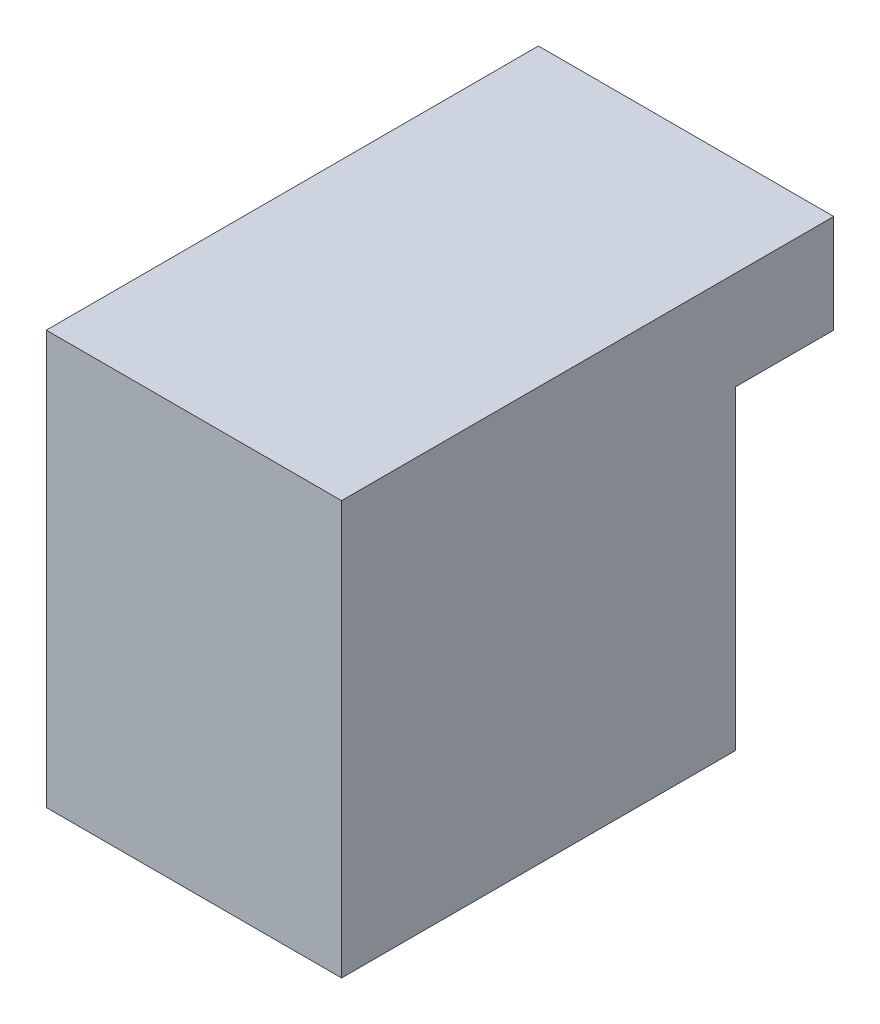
from build123d import *

# Parameters (mm, degrees)
CERROJO_DEPTH = 7.5


with BuildPart() as part:
    # Sketch1 → cerrojo (new, symmetric)
    with BuildSketch(Plane(origin=(0, 0, 0), x_dir=(0, 0, -1), z_dir=(1, 0, 0))):
        Polygon((-17.181818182, 7.909090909), (-17.181818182, -13.090909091), (2.818181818, -13.090909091), (2.818181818, 2.909090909), (7.818181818, 2.909090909), (7.818181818, 7.909090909), align=None)
    extrude(amount=CERROJO_DEPTH, both=True)


solid = part.part
